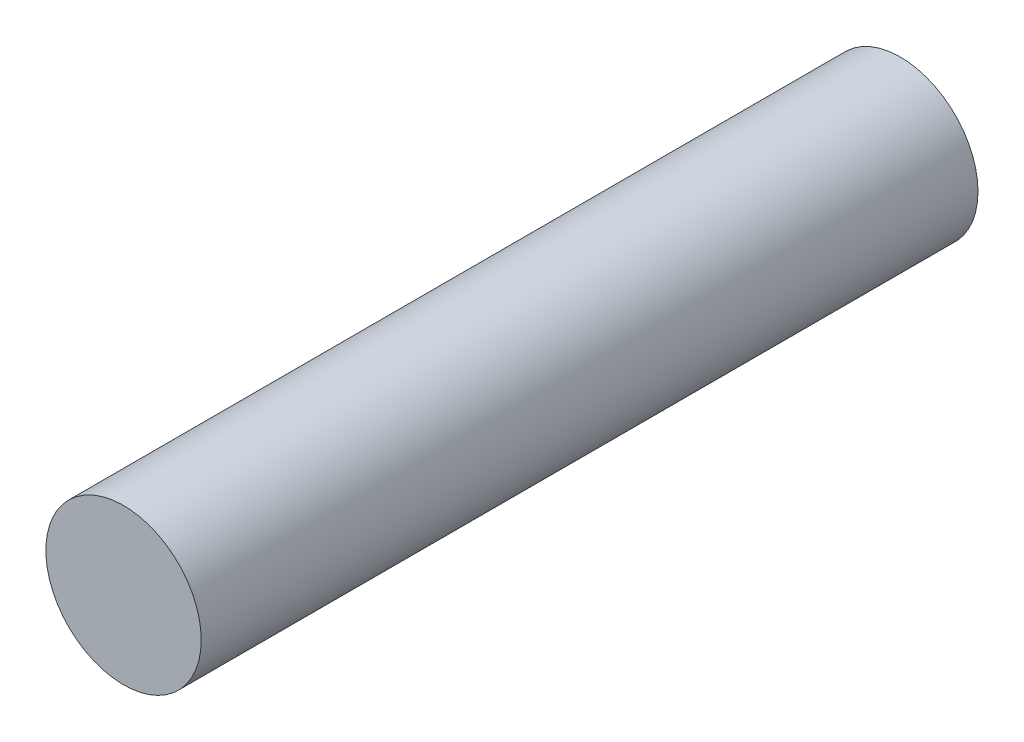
ISO-10303-21;
HEADER;
FILE_DESCRIPTION(('STEP AP214'),'2;1');
FILE_NAME('part.step','',(''),(''),'','','');
FILE_SCHEMA(('AUTOMOTIVE_DESIGN { 1 0 10303 214 1 1 1 1 }'));
ENDSEC;
DATA;
#1=APPLICATION_CONTEXT('core data for automotive mechanical design processes');
#2=APPLICATION_PROTOCOL_DEFINITION('international standard','automotive_design',2000,#1);
#3=PRODUCT_CONTEXT('',#1,'mechanical');
#4=PRODUCT('Part','Part','',(#3));
#5=PRODUCT_RELATED_PRODUCT_CATEGORY('part','',(#4));
#6=PRODUCT_DEFINITION_FORMATION('','',#4);
#7=PRODUCT_DEFINITION_CONTEXT('part definition',#1,'design');
#8=PRODUCT_DEFINITION('design','',#6,#7);
#9=PRODUCT_DEFINITION_SHAPE('','',#8);
#10=(LENGTH_UNIT() NAMED_UNIT(*) SI_UNIT(.MILLI.,.METRE.));
#11=(NAMED_UNIT(*) PLANE_ANGLE_UNIT() SI_UNIT($,.RADIAN.));
#12=(NAMED_UNIT(*) SI_UNIT($,.STERADIAN.) SOLID_ANGLE_UNIT());
#13=UNCERTAINTY_MEASURE_WITH_UNIT(LENGTH_MEASURE(1.E-05),#10,'distance_accuracy_value','');
#14=(GEOMETRIC_REPRESENTATION_CONTEXT(3) GLOBAL_UNCERTAINTY_ASSIGNED_CONTEXT((#13)) GLOBAL_UNIT_ASSIGNED_CONTEXT((#10,
#11,#12)) REPRESENTATION_CONTEXT('',''));
#15=CARTESIAN_POINT('',(0.,0.,0.));
#16=DIRECTION('',(0.,0.,1.));
#17=DIRECTION('',(1.,0.,0.));
#18=AXIS2_PLACEMENT_3D('',#15,#16,#17);
#19=CARTESIAN_POINT('',(0.,0.,-300.));
#20=DIRECTION('',(0.,0.,1.));
#21=DIRECTION('',(1.,0.,0.));
#22=AXIS2_PLACEMENT_3D('',#19,#20,#21);
#23=CYLINDRICAL_SURFACE('',#22,30.);
#24=CARTESIAN_POINT('',(0.,0.,-300.));
#25=DIRECTION('',(0.,0.,1.));
#26=DIRECTION('',(1.,0.,0.));
#27=AXIS2_PLACEMENT_3D('',#24,#25,#26);
#28=CIRCLE('',#27,30.);
#29=CARTESIAN_POINT('',(30.,0.,-300.));
#30=VERTEX_POINT('',#29);
#31=EDGE_CURVE('E10',#30,#30,#28,.T.);
#32=ORIENTED_EDGE('',*,*,#31,.T.);
#33=EDGE_LOOP('',(#32));
#34=FACE_BOUND('',#33,.T.);
#35=CARTESIAN_POINT('',(0.,0.,0.));
#36=DIRECTION('',(0.,0.,1.));
#37=DIRECTION('',(1.,0.,0.));
#38=AXIS2_PLACEMENT_3D('',#35,#36,#37);
#39=CIRCLE('',#38,30.);
#40=CARTESIAN_POINT('',(30.,0.,0.));
#41=VERTEX_POINT('',#40);
#42=EDGE_CURVE('E40',#41,#41,#39,.T.);
#43=ORIENTED_EDGE('',*,*,#42,.F.);
#44=EDGE_LOOP('',(#43));
#45=FACE_BOUND('',#44,.T.);
#46=ADVANCED_FACE('F37',(#34,#45),#23,.T.);
#47=CARTESIAN_POINT('',(0.,0.,-300.));
#48=DIRECTION('',(0.,0.,1.));
#49=DIRECTION('',(1.,0.,0.));
#50=AXIS2_PLACEMENT_3D('',#47,#48,#49);
#51=PLANE('',#50);
#52=ORIENTED_EDGE('',*,*,#31,.F.);
#53=EDGE_LOOP('',(#52));
#54=FACE_BOUND('',#53,.T.);
#55=ADVANCED_FACE('F54',(#54),#51,.F.);
#56=CARTESIAN_POINT('',(0.,0.,0.));
#57=DIRECTION('',(0.,0.,1.));
#58=DIRECTION('',(1.,0.,0.));
#59=AXIS2_PLACEMENT_3D('',#56,#57,#58);
#60=PLANE('',#59);
#61=ORIENTED_EDGE('',*,*,#42,.T.);
#62=EDGE_LOOP('',(#61));
#63=FACE_BOUND('',#62,.T.);
#64=ADVANCED_FACE('F51',(#63),#60,.T.);
#65=CLOSED_SHELL('',(#46,#55,#64));
#66=MANIFOLD_SOLID_BREP('B2',#65);
#67=ADVANCED_BREP_SHAPE_REPRESENTATION('',(#18,#66),#14);
#68=SHAPE_DEFINITION_REPRESENTATION(#9,#67);
ENDSEC;
END-ISO-10303-21;
